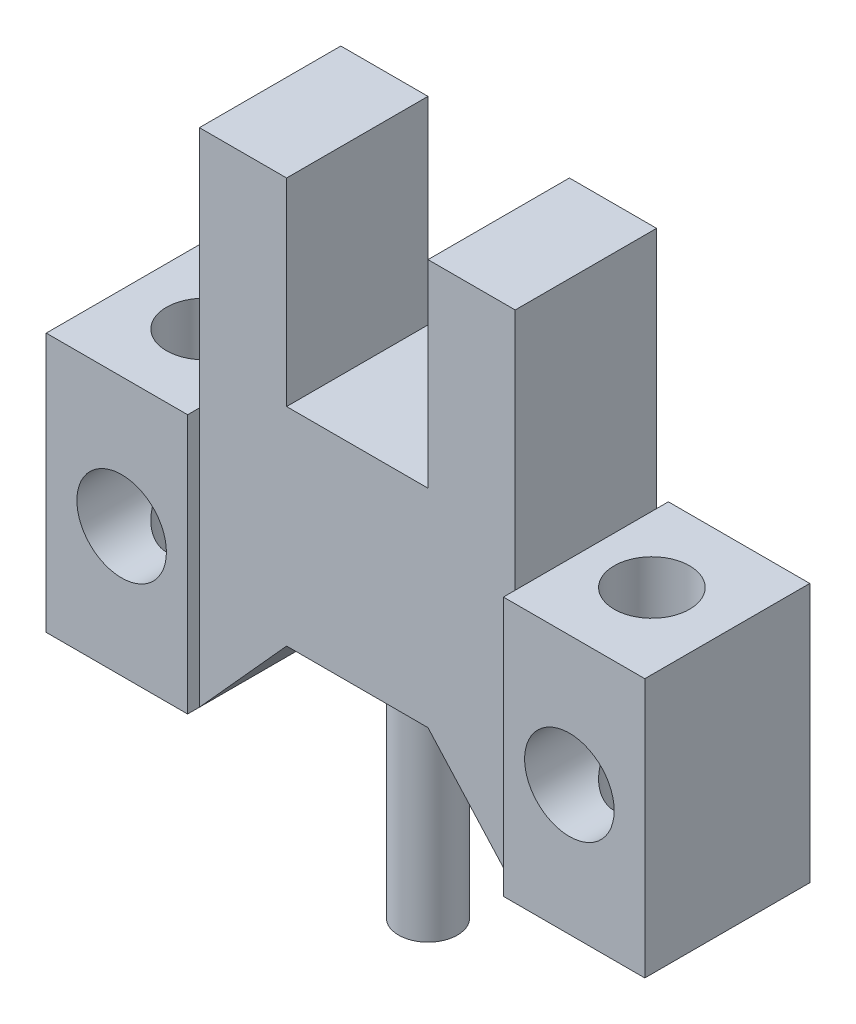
from build123d import *

# Parameters (mm, degrees)
EXTRUDE_5_DEPTH      = 7
CUT_EXTRUDE_7_DEPTH  = 0.5
CUT_EXTRUDE_8_DEPTH  = 0.5
SKETCH_11_R          = 1.9
CUT_EXTRUDE_11_DEPTH = 7
SKETCH_15_R          = 1.9
CUT_EXTRUDE_12_DEPTH = 7
SKETCH_16_R          = 1.6
CUT_EXTRUDE_13_DEPTH = 11
SKETCH_17_R          = 1.6
CUT_EXTRUDE_14_DEPTH = 11
SKETCH_18_R          = 1.25
EXTRUDE_7_DEPTH      = 10
SKETCH_19_W          = 6
SKETCH_19_H          = 6
EXTRUDE_8_DEPTH      = 1.9


with BuildPart() as part:
    # Sketch 1 → Extrude 5 (new body)
    with BuildSketch(Plane.XY):
        Polygon((0, 0), (0, 11), (6, 11), (6, 21.3), (9.7, 21.3), (9.7, 11), (15.7, 11), (15.7, 21.3), (19.4, 21.3), (19.4, 11), (25.4, 11), (25.4, 0), (19.4, 0), (15.7, 4.1), (9.7, 4.1), (6, 0), align=None)
    extrude(amount=EXTRUDE_5_DEPTH)

    # Sketch 9 → Cut-Extrude 7 (cut)
    with BuildSketch(Plane.XY.offset(7)):
        Polygon((6, 0), (6, 21.3), (9.7, 21.3), (9.7, 11), (15.7, 11), (15.7, 21.3), (19.4, 21.3), (19.4, 0), (15.7, 4.1), (9.7, 4.1), align=None)
    extrude(amount=-CUT_EXTRUDE_7_DEPTH, mode=Mode.SUBTRACT)

    # Sketch 10 → Cut-Extrude 8 (cut)
    with BuildSketch(Plane(origin=(0, 0, 0), x_dir=(-1, 0, 0), z_dir=(0, 0, -1))):
        Polygon((-19.4, 0), (-19.4, 21.3), (-15.7, 21.3), (-15.7, 11), (-9.7, 11), (-9.7, 21.3), (-6, 21.3), (-6, 0), (-9.7, 4.1), (-15.7, 4.1), align=None)
    extrude(amount=-CUT_EXTRUDE_8_DEPTH, mode=Mode.SUBTRACT)

    # Sketch 11 → Cut-Extrude 11 (cut)
    with BuildSketch(Plane.XY.offset(7)):
        with Locations((3.2, 5.5)):
            Circle(SKETCH_11_R)
    extrude(amount=-CUT_EXTRUDE_11_DEPTH, mode=Mode.SUBTRACT)

    # Sketch 15 → Cut-Extrude 12 (cut)
    with BuildSketch(Plane.XY.offset(7)):
        with Locations((22.2, 5.5)):
            Circle(SKETCH_15_R)
    extrude(amount=-CUT_EXTRUDE_12_DEPTH, mode=Mode.SUBTRACT)

    # Sketch 16 → Cut-Extrude 13 (cut)
    with BuildSketch(Plane(origin=(0, 11, 0), x_dir=(1, 0, 0), z_dir=(0, 1, 0))):
        with Locations(Location((3.2, -3.5, 0), (0, 0, 270))):
            Circle(SKETCH_16_R)
    extrude(amount=-CUT_EXTRUDE_13_DEPTH, mode=Mode.SUBTRACT)

    # Sketch 17 → Cut-Extrude 14 (cut)
    with BuildSketch(Plane(origin=(0, 11, 0), x_dir=(1, 0, 0), z_dir=(0, 1, 0))):
        with Locations(Location((22.2, -3.5, 0), (0, 0, 270))):
            Circle(SKETCH_17_R)
    extrude(amount=-CUT_EXTRUDE_14_DEPTH, mode=Mode.SUBTRACT)

    # Sketch 18 → Extrude 7 (add)
    with BuildSketch(Plane.XZ.offset(-4.1)):
        with Locations(Location((12.7, 3.5, 0), (0, 0, 90))):
            Circle(SKETCH_18_R)
    extrude(amount=EXTRUDE_7_DEPTH)

    # Sketch 19 → Extrude 8 (add)
    with BuildSketch(Plane(origin=(0, 11, 0), x_dir=(1, 0, 0), z_dir=(0, 1, 0))):
        with Locations((12.7, -3.5)):
            Rectangle(SKETCH_19_W, SKETCH_19_H)
    extrude(amount=EXTRUDE_8_DEPTH)


solid = part.part
